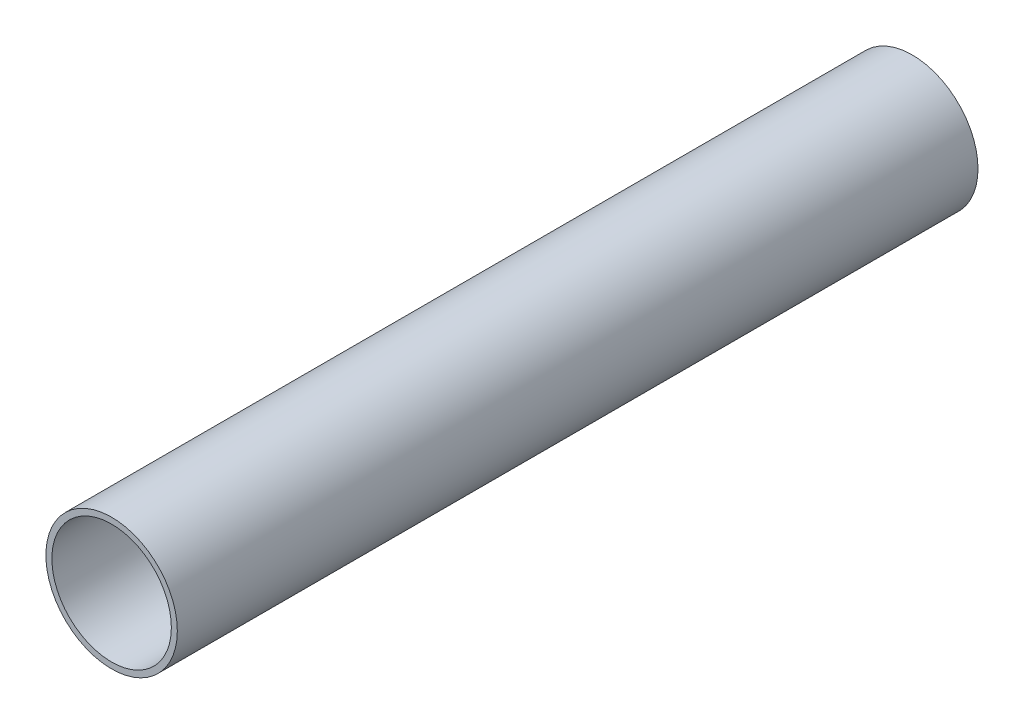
ISO-10303-21;
HEADER;
FILE_DESCRIPTION(('STEP AP214'),'2;1');
FILE_NAME('part.step','',(''),(''),'','','');
FILE_SCHEMA(('AUTOMOTIVE_DESIGN { 1 0 10303 214 1 1 1 1 }'));
ENDSEC;
DATA;
#1=APPLICATION_CONTEXT('core data for automotive mechanical design processes');
#2=APPLICATION_PROTOCOL_DEFINITION('international standard','automotive_design',2000,#1);
#3=PRODUCT_CONTEXT('',#1,'mechanical');
#4=PRODUCT('Part','Part','',(#3));
#5=PRODUCT_RELATED_PRODUCT_CATEGORY('part','',(#4));
#6=PRODUCT_DEFINITION_FORMATION('','',#4);
#7=PRODUCT_DEFINITION_CONTEXT('part definition',#1,'design');
#8=PRODUCT_DEFINITION('design','',#6,#7);
#9=PRODUCT_DEFINITION_SHAPE('','',#8);
#10=(LENGTH_UNIT() NAMED_UNIT(*) SI_UNIT(.MILLI.,.METRE.));
#11=(NAMED_UNIT(*) PLANE_ANGLE_UNIT() SI_UNIT($,.RADIAN.));
#12=(NAMED_UNIT(*) SI_UNIT($,.STERADIAN.) SOLID_ANGLE_UNIT());
#13=UNCERTAINTY_MEASURE_WITH_UNIT(LENGTH_MEASURE(1.E-05),#10,'distance_accuracy_value','');
#14=(GEOMETRIC_REPRESENTATION_CONTEXT(3) GLOBAL_UNCERTAINTY_ASSIGNED_CONTEXT((#13)) GLOBAL_UNIT_ASSIGNED_CONTEXT((#10,
#11,#12)) REPRESENTATION_CONTEXT('',''));
#15=CARTESIAN_POINT('',(0.,0.,0.));
#16=DIRECTION('',(0.,0.,1.));
#17=DIRECTION('',(1.,0.,0.));
#18=AXIS2_PLACEMENT_3D('',#15,#16,#17);
#19=CARTESIAN_POINT('',(0.,0.,-335.));
#20=DIRECTION('',(0.,0.,1.));
#21=DIRECTION('',(1.,0.,0.));
#22=AXIS2_PLACEMENT_3D('',#19,#20,#21);
#23=CYLINDRICAL_SURFACE('',#22,27.5);
#24=CARTESIAN_POINT('',(0.,0.,-335.));
#25=DIRECTION('',(0.,0.,1.));
#26=DIRECTION('',(1.,0.,0.));
#27=AXIS2_PLACEMENT_3D('',#24,#25,#26);
#28=CIRCLE('',#27,27.5);
#29=CARTESIAN_POINT('',(27.5,0.,-335.));
#30=VERTEX_POINT('',#29);
#31=EDGE_CURVE('E10',#30,#30,#28,.T.);
#32=ORIENTED_EDGE('',*,*,#31,.T.);
#33=EDGE_LOOP('',(#32));
#34=FACE_BOUND('',#33,.T.);
#35=CARTESIAN_POINT('',(0.,0.,0.));
#36=DIRECTION('',(0.,0.,1.));
#37=DIRECTION('',(1.,0.,0.));
#38=AXIS2_PLACEMENT_3D('',#35,#36,#37);
#39=CIRCLE('',#38,27.5);
#40=CARTESIAN_POINT('',(27.5,0.,0.));
#41=VERTEX_POINT('',#40);
#42=EDGE_CURVE('E352',#41,#41,#39,.T.);
#43=ORIENTED_EDGE('',*,*,#42,.F.);
#44=EDGE_LOOP('',(#43));
#45=FACE_BOUND('',#44,.T.);
#46=ADVANCED_FACE('F346',(#34,#45),#23,.T.);
#47=CARTESIAN_POINT('',(0.,0.,-335.));
#48=DIRECTION('',(0.,0.,1.));
#49=DIRECTION('',(1.,0.,0.));
#50=AXIS2_PLACEMENT_3D('',#47,#48,#49);
#51=PLANE('',#50);
#52=CARTESIAN_POINT('',(0.,0.,-335.));
#53=DIRECTION('',(0.,0.,1.));
#54=DIRECTION('',(1.,0.,0.));
#55=AXIS2_PLACEMENT_3D('',#52,#53,#54);
#56=CIRCLE('',#55,25.);
#57=CARTESIAN_POINT('',(25.,0.,-335.));
#58=VERTEX_POINT('',#57);
#59=EDGE_CURVE('E356',#58,#58,#56,.T.);
#60=ORIENTED_EDGE('',*,*,#59,.T.);
#61=EDGE_LOOP('',(#60));
#62=FACE_BOUND('',#61,.T.);
#63=ORIENTED_EDGE('',*,*,#31,.F.);
#64=EDGE_LOOP('',(#63));
#65=FACE_BOUND('',#64,.T.);
#66=ADVANCED_FACE('F370',(#62,#65),#51,.F.);
#67=CARTESIAN_POINT('',(0.,0.,0.));
#68=DIRECTION('',(0.,0.,1.));
#69=DIRECTION('',(1.,0.,0.));
#70=AXIS2_PLACEMENT_3D('',#67,#68,#69);
#71=PLANE('',#70);
#72=CARTESIAN_POINT('',(0.,0.,0.));
#73=DIRECTION('',(0.,0.,1.));
#74=DIRECTION('',(1.,0.,0.));
#75=AXIS2_PLACEMENT_3D('',#72,#73,#74);
#76=CIRCLE('',#75,25.);
#77=CARTESIAN_POINT('',(25.,0.,0.));
#78=VERTEX_POINT('',#77);
#79=EDGE_CURVE('E360',#78,#78,#76,.T.);
#80=ORIENTED_EDGE('',*,*,#79,.F.);
#81=EDGE_LOOP('',(#80));
#82=FACE_BOUND('',#81,.T.);
#83=ORIENTED_EDGE('',*,*,#42,.T.);
#84=EDGE_LOOP('',(#83));
#85=FACE_BOUND('',#84,.T.);
#86=ADVANCED_FACE('F368',(#82,#85),#71,.T.);
#87=CARTESIAN_POINT('',(0.,0.,-335.));
#88=DIRECTION('',(0.,0.,1.));
#89=DIRECTION('',(1.,0.,0.));
#90=AXIS2_PLACEMENT_3D('',#87,#88,#89);
#91=CYLINDRICAL_SURFACE('',#90,25.);
#92=ORIENTED_EDGE('',*,*,#59,.F.);
#93=EDGE_LOOP('',(#92));
#94=FACE_BOUND('',#93,.T.);
#95=ORIENTED_EDGE('',*,*,#79,.T.);
#96=EDGE_LOOP('',(#95));
#97=FACE_BOUND('',#96,.T.);
#98=ADVANCED_FACE('F366',(#94,#97),#91,.F.);
#99=CLOSED_SHELL('',(#46,#66,#86,#98));
#100=MANIFOLD_SOLID_BREP('B2',#99);
#101=ADVANCED_BREP_SHAPE_REPRESENTATION('',(#18,#100),#14);
#102=SHAPE_DEFINITION_REPRESENTATION(#9,#101);
ENDSEC;
END-ISO-10303-21;
